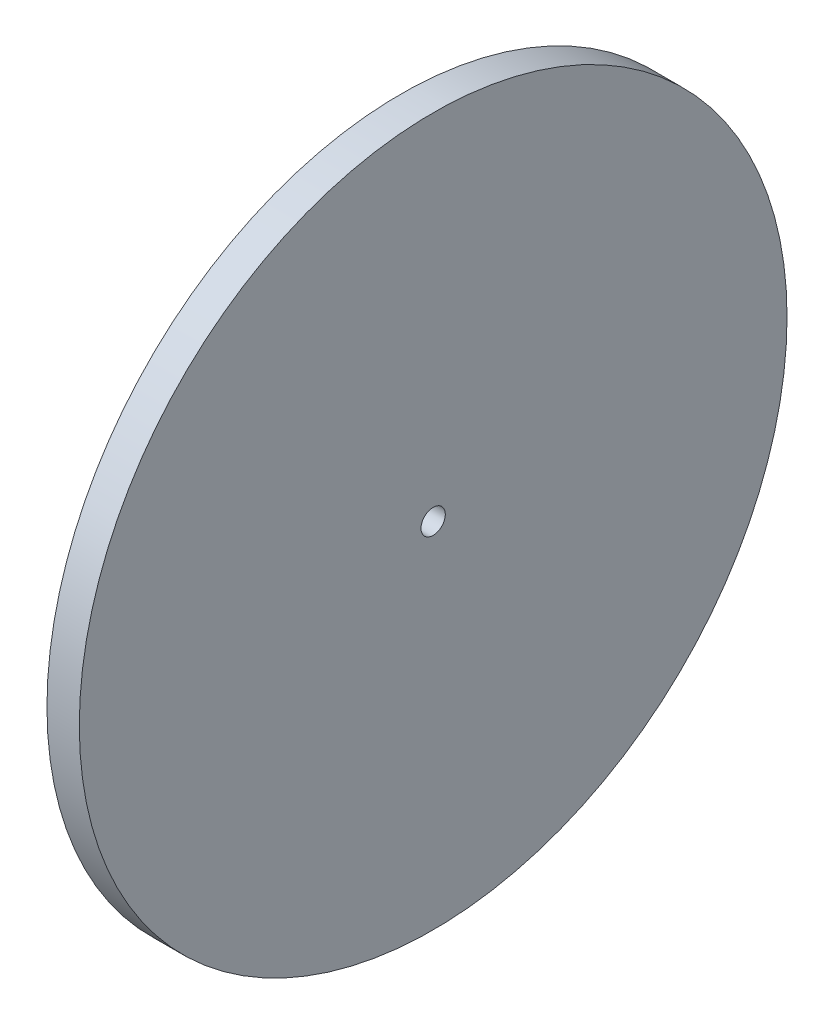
ISO-10303-21;
HEADER;
FILE_DESCRIPTION(('STEP AP214'),'2;1');
FILE_NAME('part.step','',(''),(''),'','','');
FILE_SCHEMA(('AUTOMOTIVE_DESIGN { 1 0 10303 214 1 1 1 1 }'));
ENDSEC;
DATA;
#1=APPLICATION_CONTEXT('core data for automotive mechanical design processes');
#2=APPLICATION_PROTOCOL_DEFINITION('international standard','automotive_design',2000,#1);
#3=PRODUCT_CONTEXT('',#1,'mechanical');
#4=PRODUCT('Part','Part','',(#3));
#5=PRODUCT_RELATED_PRODUCT_CATEGORY('part','',(#4));
#6=PRODUCT_DEFINITION_FORMATION('','',#4);
#7=PRODUCT_DEFINITION_CONTEXT('part definition',#1,'design');
#8=PRODUCT_DEFINITION('design','',#6,#7);
#9=PRODUCT_DEFINITION_SHAPE('','',#8);
#10=(LENGTH_UNIT() NAMED_UNIT(*) SI_UNIT(.MILLI.,.METRE.));
#11=(NAMED_UNIT(*) PLANE_ANGLE_UNIT() SI_UNIT($,.RADIAN.));
#12=(NAMED_UNIT(*) SI_UNIT($,.STERADIAN.) SOLID_ANGLE_UNIT());
#13=UNCERTAINTY_MEASURE_WITH_UNIT(LENGTH_MEASURE(1.E-05),#10,'distance_accuracy_value','');
#14=(GEOMETRIC_REPRESENTATION_CONTEXT(3) GLOBAL_UNCERTAINTY_ASSIGNED_CONTEXT((#13)) GLOBAL_UNIT_ASSIGNED_CONTEXT((#10,
#11,#12)) REPRESENTATION_CONTEXT('',''));
#15=CARTESIAN_POINT('',(0.,0.,0.));
#16=DIRECTION('',(0.,0.,1.));
#17=DIRECTION('',(1.,0.,0.));
#18=AXIS2_PLACEMENT_3D('',#15,#16,#17);
#19=CARTESIAN_POINT('',(8.,0.,0.));
#20=DIRECTION('',(1.,0.,0.));
#21=DIRECTION('',(0.,0.,-1.));
#22=AXIS2_PLACEMENT_3D('',#19,#20,#21);
#23=PLANE('',#22);
#24=CARTESIAN_POINT('',(8.,0.,0.));
#25=DIRECTION('',(1.,0.,0.));
#26=DIRECTION('',(0.,0.,-1.));
#27=AXIS2_PLACEMENT_3D('',#24,#25,#26);
#28=CIRCLE('',#27,87.535);
#29=CARTESIAN_POINT('',(8.,0.,-87.535));
#30=VERTEX_POINT('',#29);
#31=EDGE_CURVE('E10',#30,#30,#28,.T.);
#32=ORIENTED_EDGE('',*,*,#31,.T.);
#33=EDGE_LOOP('',(#32));
#34=FACE_BOUND('',#33,.T.);
#35=CARTESIAN_POINT('',(8.,0.,0.));
#36=DIRECTION('',(1.,0.,0.));
#37=DIRECTION('',(0.,0.,-1.));
#38=AXIS2_PLACEMENT_3D('',#35,#36,#37);
#39=CIRCLE('',#38,3.);
#40=CARTESIAN_POINT('',(8.,0.,-3.));
#41=VERTEX_POINT('',#40);
#42=EDGE_CURVE('E46',#41,#41,#39,.T.);
#43=ORIENTED_EDGE('',*,*,#42,.F.);
#44=EDGE_LOOP('',(#43));
#45=FACE_BOUND('',#44,.T.);
#46=ADVANCED_FACE('F35',(#34,#45),#23,.T.);
#47=CARTESIAN_POINT('',(0.,0.,0.));
#48=DIRECTION('',(1.,0.,0.));
#49=DIRECTION('',(0.,0.,-1.));
#50=AXIS2_PLACEMENT_3D('',#47,#48,#49);
#51=PLANE('',#50);
#52=CARTESIAN_POINT('',(0.,0.,0.));
#53=DIRECTION('',(1.,0.,0.));
#54=DIRECTION('',(0.,0.,-1.));
#55=AXIS2_PLACEMENT_3D('',#52,#53,#54);
#56=CIRCLE('',#55,87.535);
#57=CARTESIAN_POINT('',(0.,0.,-87.535));
#58=VERTEX_POINT('',#57);
#59=EDGE_CURVE('E39',#58,#58,#56,.T.);
#60=ORIENTED_EDGE('',*,*,#59,.F.);
#61=EDGE_LOOP('',(#60));
#62=FACE_BOUND('',#61,.T.);
#63=CARTESIAN_POINT('',(0.,0.,0.));
#64=DIRECTION('',(1.,0.,0.));
#65=DIRECTION('',(0.,0.,-1.));
#66=AXIS2_PLACEMENT_3D('',#63,#64,#65);
#67=CIRCLE('',#66,3.);
#68=CARTESIAN_POINT('',(0.,0.,-3.));
#69=VERTEX_POINT('',#68);
#70=EDGE_CURVE('E48',#69,#69,#67,.T.);
#71=ORIENTED_EDGE('',*,*,#70,.T.);
#72=EDGE_LOOP('',(#71));
#73=FACE_BOUND('',#72,.T.);
#74=ADVANCED_FACE('F58',(#62,#73),#51,.F.);
#75=CARTESIAN_POINT('',(8.,0.,0.));
#76=DIRECTION('',(-1.,0.,0.));
#77=DIRECTION('',(0.,0.,1.));
#78=AXIS2_PLACEMENT_3D('',#75,#76,#77);
#79=CYLINDRICAL_SURFACE('',#78,87.535);
#80=ORIENTED_EDGE('',*,*,#31,.F.);
#81=EDGE_LOOP('',(#80));
#82=FACE_BOUND('',#81,.T.);
#83=ORIENTED_EDGE('',*,*,#59,.T.);
#84=EDGE_LOOP('',(#83));
#85=FACE_BOUND('',#84,.T.);
#86=ADVANCED_FACE('F37',(#82,#85),#79,.T.);
#87=CARTESIAN_POINT('',(8.,0.,0.));
#88=DIRECTION('',(-1.,0.,0.));
#89=DIRECTION('',(0.,0.,1.));
#90=AXIS2_PLACEMENT_3D('',#87,#88,#89);
#91=CYLINDRICAL_SURFACE('',#90,3.);
#92=ORIENTED_EDGE('',*,*,#42,.T.);
#93=EDGE_LOOP('',(#92));
#94=FACE_BOUND('',#93,.T.);
#95=ORIENTED_EDGE('',*,*,#70,.F.);
#96=EDGE_LOOP('',(#95));
#97=FACE_BOUND('',#96,.T.);
#98=ADVANCED_FACE('F54',(#94,#97),#91,.F.);
#99=CLOSED_SHELL('',(#46,#74,#86,#98));
#100=MANIFOLD_SOLID_BREP('B2',#99);
#101=ADVANCED_BREP_SHAPE_REPRESENTATION('',(#18,#100),#14);
#102=SHAPE_DEFINITION_REPRESENTATION(#9,#101);
ENDSEC;
END-ISO-10303-21;
